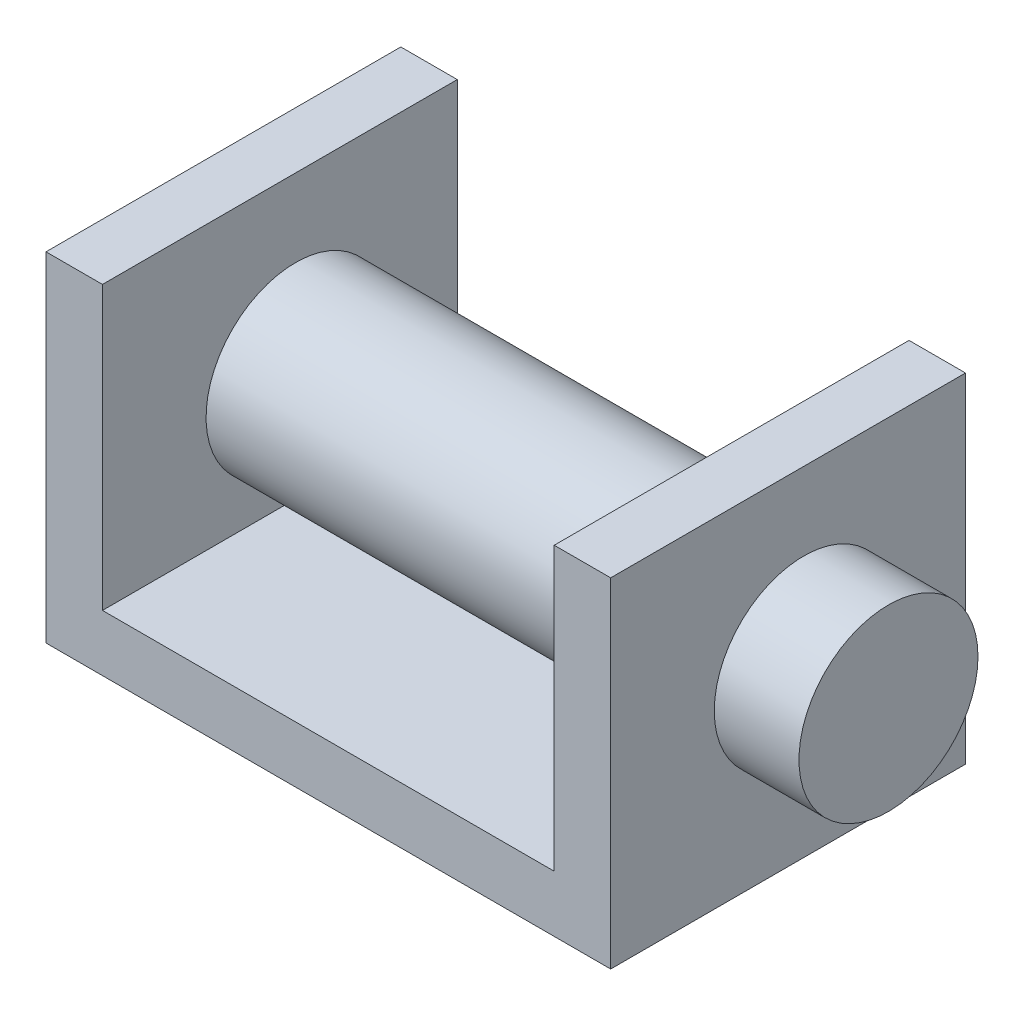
from build123d import *

# Parameters (mm, degrees)
EXTRUDE1_DEPTH      = 31.417249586
BOSS_EXTRUDE1_REACH = 135.462
SKETCH4_R           = 15.852266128


with BuildPart() as part:
    # Sketch3 → Extrude1 (new, symmetric)
    with BuildSketch(Plane.XY):
        Polygon((-50, 60), (-50, 0), (50, 0), (50, 60), (40, 60), (40, 10), (-40, 10), (-40, 60), align=None)
    extrude(amount=EXTRUDE1_DEPTH, both=True)

    # Sketch4 → Boss-Extrude1 (add, up to next)
    with BuildSketch(Plane(origin=(65, 0, 0), x_dir=(0, 0, -1), z_dir=(1, 0, 0)), mode=Mode.PRIVATE) as boss_extrude1_sk1:
        with Locations((2.780034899, 30.404129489)):
            Circle(SKETCH4_R)
    boss_extrude1_tool1 = extrude(boss_extrude1_sk1.sketch, amount=-BOSS_EXTRUDE1_REACH, mode=Mode.PRIVATE) - part.part
    add(boss_extrude1_tool1.solids().sort_by_distance((65, 30.404129, -2.780035))[0])
    add(boss_extrude1_tool1.solids().sort_by_distance((65, 30.404129, -2.780035))[1])


solid = part.part
